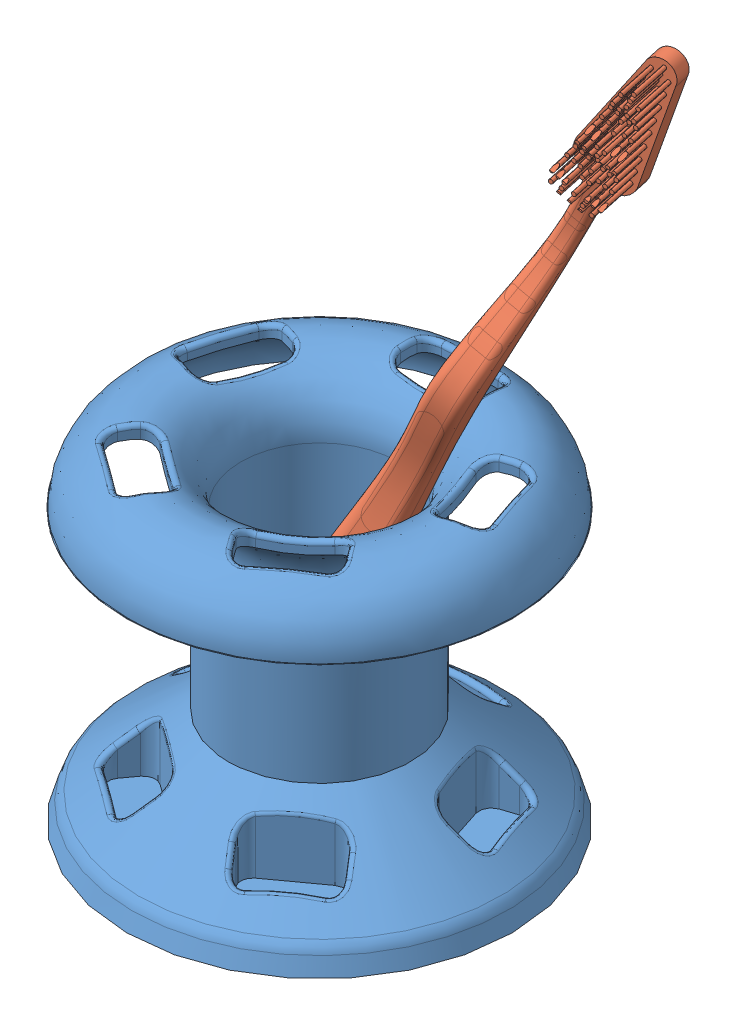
SolidWorks assembly SW3dPS-toothbrush and support.SLDASM, configuration Default (file format 3100). Lengths in mm.
Overall size (120.75 184.73 95).
2 component instances, 2 part files, 0 mates.
Components (placement in the parent):
- SW3dPS-toothbrush and support_suport periute de dinti-1: SW3dPS-toothbrush and support_suport periute de dinti.SLDPRT [Default] at origin size (95 81.27 95)
- SW3dPS-toothbrush and support_toothbrush-1: SW3dPS-toothbrush and support_toothbrush.SLDPRT [Default] at (47.3851 150.8953 -23.73) x (0.882383 -0.427954 -0.19559) z (-0.413584 -0.903634 0.111325) size (14.66 28.13 193.5)
